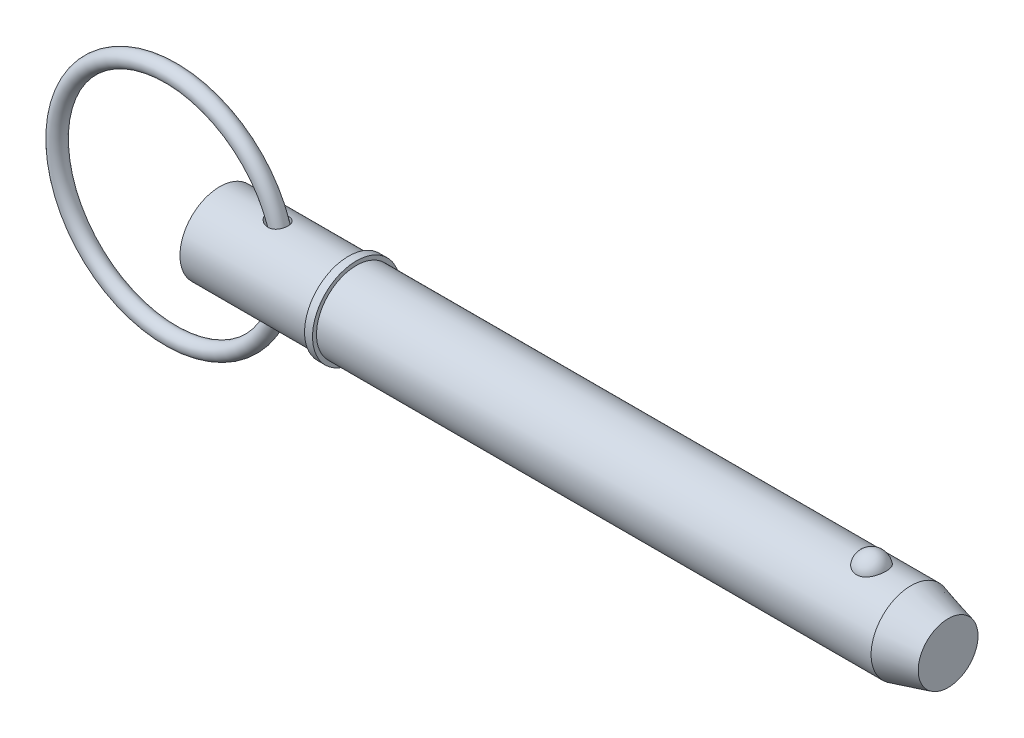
ISO-10303-21;
HEADER;
FILE_DESCRIPTION(('STEP AP214'),'2;1');
FILE_NAME('part.step','',(''),(''),'','','');
FILE_SCHEMA(('AUTOMOTIVE_DESIGN { 1 0 10303 214 1 1 1 1 }'));
ENDSEC;
DATA;
#1=APPLICATION_CONTEXT('core data for automotive mechanical design processes');
#2=APPLICATION_PROTOCOL_DEFINITION('international standard','automotive_design',2000,#1);
#3=PRODUCT_CONTEXT('',#1,'mechanical');
#4=PRODUCT('Part','Part','',(#3));
#5=PRODUCT_RELATED_PRODUCT_CATEGORY('part','',(#4));
#6=PRODUCT_DEFINITION_FORMATION('','',#4);
#7=PRODUCT_DEFINITION_CONTEXT('part definition',#1,'design');
#8=PRODUCT_DEFINITION('design','',#6,#7);
#9=PRODUCT_DEFINITION_SHAPE('','',#8);
#10=(LENGTH_UNIT() NAMED_UNIT(*) SI_UNIT(.MILLI.,.METRE.));
#11=(NAMED_UNIT(*) PLANE_ANGLE_UNIT() SI_UNIT($,.RADIAN.));
#12=(NAMED_UNIT(*) SI_UNIT($,.STERADIAN.) SOLID_ANGLE_UNIT());
#13=UNCERTAINTY_MEASURE_WITH_UNIT(LENGTH_MEASURE(1.E-05),#10,'distance_accuracy_value','');
#14=(GEOMETRIC_REPRESENTATION_CONTEXT(3) GLOBAL_UNCERTAINTY_ASSIGNED_CONTEXT((#13)) GLOBAL_UNIT_ASSIGNED_CONTEXT((#10,
#11,#12)) REPRESENTATION_CONTEXT('',''));
#15=CARTESIAN_POINT('',(0.,0.,0.));
#16=DIRECTION('',(0.,0.,1.));
#17=DIRECTION('',(1.,0.,0.));
#18=AXIS2_PLACEMENT_3D('',#15,#16,#17);
#19=CARTESIAN_POINT('',(-13.640845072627,0.,0.));
#20=DIRECTION('',(0.,0.,1.));
#21=DIRECTION('',(1.,0.,0.));
#22=AXIS2_PLACEMENT_3D('',#19,#20,#21);
#23=TOROIDAL_SURFACE('',#22,31.75,2.223);
#24=CARTESIAN_POINT('',(20.332154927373,0.,0.));
#25=VERTEX_POINT('',#24);
#26=VERTEX_LOOP('',#25);
#27=FACE_BOUND('',#26,.T.);
#28=ADVANCED_FACE('P0_F12',(#27),#23,.T.);
#29=CLOSED_SHELL('',(#28));
#30=MANIFOLD_SOLID_BREP('P0_B1',#29);
#31=CARTESIAN_POINT('',(0.,0.,0.));
#32=DIRECTION('',(1.,0.,0.));
#33=DIRECTION('',(0.,0.,-1.));
#34=AXIS2_PLACEMENT_3D('',#31,#32,#33);
#35=CYLINDRICAL_SURFACE('',#34,11.115);
#36=CARTESIAN_POINT('',(13.5245830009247,11.0328953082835,-1.34849772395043));
#37=CARTESIAN_POINT('',(13.6190616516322,11.0150940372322,-1.49413162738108));
#38=CARTESIAN_POINT('',(13.7272589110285,10.9954577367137,-1.63076546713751));
#39=CARTESIAN_POINT('',(13.9654537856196,10.9550099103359,-1.8834727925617));
#40=CARTESIAN_POINT('',(14.0954990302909,10.9341958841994,-1.99950019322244));
#41=CARTESIAN_POINT('',(14.3718600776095,10.893854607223,-2.20871939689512));
#42=CARTESIAN_POINT('',(14.5180879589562,10.8743212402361,-2.30202655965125));
#43=CARTESIAN_POINT('',(14.8233821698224,10.8385071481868,-2.46515115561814));
#44=CARTESIAN_POINT('',(14.9824448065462,10.8222254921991,-2.53497531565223));
#45=CARTESIAN_POINT('',(15.3233581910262,10.7936101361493,-2.65430007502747));
#46=CARTESIAN_POINT('',(15.5060064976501,10.7817126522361,-2.7016502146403));
#47=CARTESIAN_POINT('',(15.8771124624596,10.7657570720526,-2.76455948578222));
#48=CARTESIAN_POINT('',(16.0655695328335,10.7616981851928,-2.78012182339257));
#49=CARTESIAN_POINT('',(16.4345152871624,10.7624400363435,-2.77724928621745));
#50=CARTESIAN_POINT('',(16.6150121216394,10.7668823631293,-2.76018977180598));
#51=CARTESIAN_POINT('',(16.9695132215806,10.7837407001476,-2.69357457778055));
#52=CARTESIAN_POINT('',(17.1435222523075,10.7961507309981,-2.64404326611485));
#53=CARTESIAN_POINT('',(17.4621418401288,10.8258984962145,-2.51928348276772));
#54=CARTESIAN_POINT('',(17.6079677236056,10.8426430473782,-2.44700611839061));
#55=CARTESIAN_POINT('',(17.884162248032,10.8794194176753,-2.27791740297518));
#56=CARTESIAN_POINT('',(18.0145349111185,10.8994503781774,-2.18111245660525));
#57=CARTESIAN_POINT('',(18.2494965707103,10.9392822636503,-1.9713196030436));
#58=CARTESIAN_POINT('',(18.3550661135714,10.9590421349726,-1.85941863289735));
#59=CARTESIAN_POINT('',(18.5458147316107,10.9970986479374,-1.61919918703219));
#60=CARTESIAN_POINT('',(18.6309947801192,11.0153953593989,-1.49088149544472));
#61=CARTESIAN_POINT('',(18.7786686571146,11.0484675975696,-1.2218388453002));
#62=CARTESIAN_POINT('',(18.8412214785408,11.063252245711,-1.08114735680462));
#63=CARTESIAN_POINT('',(18.9425265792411,11.0877718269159,-0.791025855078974));
#64=CARTESIAN_POINT('',(18.9812780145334,11.0975065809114,-0.641595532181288));
#65=CARTESIAN_POINT('',(19.0343305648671,11.1109435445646,-0.336997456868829));
#66=CARTESIAN_POINT('',(19.0484404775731,11.1145985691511,-0.181794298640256));
#67=CARTESIAN_POINT('',(19.0513147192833,11.1153384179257,0.1288646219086));
#68=CARTESIAN_POINT('',(19.0400783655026,11.112423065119,0.284320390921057));
#69=CARTESIAN_POINT('',(18.9924362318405,11.1003163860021,0.591525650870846));
#70=CARTESIAN_POINT('',(18.9559600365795,11.0911075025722,0.743263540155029));
#71=CARTESIAN_POINT('',(18.858576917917,11.0673920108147,1.03825247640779));
#72=CARTESIAN_POINT('',(18.7976699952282,11.0528854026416,1.18150352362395));
#73=CARTESIAN_POINT('',(18.6529960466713,11.020201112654,1.45511394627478));
#74=CARTESIAN_POINT('',(18.5692772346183,11.0020311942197,1.58549973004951));
#75=CARTESIAN_POINT('',(18.3810003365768,10.9640237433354,1.82995492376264));
#76=CARTESIAN_POINT('',(18.2764441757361,10.9441863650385,1.9440258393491));
#77=CARTESIAN_POINT('',(18.0501398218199,10.9052267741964,2.15183128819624));
#78=CARTESIAN_POINT('',(17.9285270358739,10.8861003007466,2.24571250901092));
#79=CARTESIAN_POINT('',(17.6709592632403,10.8505244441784,2.41175942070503));
#80=CARTESIAN_POINT('',(17.5350055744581,10.8340748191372,2.48392707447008));
#81=CARTESIAN_POINT('',(17.2528390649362,10.8056099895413,2.60497667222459));
#82=CARTESIAN_POINT('',(17.1066353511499,10.7935909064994,2.65387899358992));
#83=CARTESIAN_POINT('',(16.8080326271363,10.7750969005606,2.72799859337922));
#84=CARTESIAN_POINT('',(16.6556326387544,10.7686228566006,2.75321211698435));
#85=CARTESIAN_POINT('',(16.3428877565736,10.761517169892,2.78086153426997));
#86=CARTESIAN_POINT('',(16.1824599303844,10.7611149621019,2.78240297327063));
#87=CARTESIAN_POINT('',(15.863296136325,10.766478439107,2.76156874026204));
#88=CARTESIAN_POINT('',(15.7045607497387,10.7722461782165,2.73918510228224));
#89=CARTESIAN_POINT('',(15.3787211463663,10.7898500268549,2.66904167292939));
#90=CARTESIAN_POINT('',(15.2120794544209,10.8021675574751,2.6192557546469));
#91=CARTESIAN_POINT('',(14.8886284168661,10.8315482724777,2.4949635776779));
#92=CARTESIAN_POINT('',(14.731827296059,10.8486153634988,2.42043695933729));
#93=CARTESIAN_POINT('',(14.4198762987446,10.8870804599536,2.24137362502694));
#94=CARTESIAN_POINT('',(14.2658484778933,10.9087148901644,2.13492229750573));
#95=CARTESIAN_POINT('',(13.9788214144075,10.9526299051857,1.89676517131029));
#96=CARTESIAN_POINT('',(13.845804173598,10.9749099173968,1.76508120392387));
#97=CARTESIAN_POINT('',(13.6310853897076,11.012885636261,1.50762337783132));
#98=CARTESIAN_POINT('',(13.5444453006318,11.0290026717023,1.38602082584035));
#99=CARTESIAN_POINT('',(13.392158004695,11.0581740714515,1.12983363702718));
#100=CARTESIAN_POINT('',(13.3264946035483,11.0712307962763,0.995259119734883));
#101=CARTESIAN_POINT('',(13.2464179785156,11.0874250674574,0.785640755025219));
#102=CARTESIAN_POINT('',(13.2227369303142,11.0922707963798,0.71416661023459));
#103=CARTESIAN_POINT('',(13.1820656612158,11.1006486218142,0.56927708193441));
#104=CARTESIAN_POINT('',(13.1650721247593,11.1041813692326,0.495862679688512));
#105=CARTESIAN_POINT('',(13.1381118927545,11.1098070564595,0.34771199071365));
#106=CARTESIAN_POINT('',(13.1281436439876,11.1119003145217,0.272975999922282));
#107=CARTESIAN_POINT('',(13.1154243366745,11.1145746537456,0.122890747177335));
#108=CARTESIAN_POINT('',(13.1126723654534,11.1151559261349,0.0475415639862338));
#109=CARTESIAN_POINT('',(13.1151602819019,11.1146296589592,-0.160384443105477));
#110=CARTESIAN_POINT('',(13.128061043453,11.111903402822,-0.292944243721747));
#111=CARTESIAN_POINT('',(13.175691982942,11.1019662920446,-0.553751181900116));
#112=CARTESIAN_POINT('',(13.2104121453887,11.094757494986,-0.682000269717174));
#113=CARTESIAN_POINT('',(13.2891255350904,11.0787645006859,-0.901873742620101));
#114=CARTESIAN_POINT('',(13.3290466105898,11.0707438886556,-0.995044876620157));
#115=CARTESIAN_POINT('',(13.4192915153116,11.0529876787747,-1.175992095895));
#116=CARTESIAN_POINT('',(13.4696154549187,11.0432520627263,-1.26376812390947));
#117=CARTESIAN_POINT('',(13.5245830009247,11.0328953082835,-1.34849772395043));
#118=B_SPLINE_CURVE_WITH_KNOTS('',3,(#36,#37,#38,#39,#40,#41,#42,#43,#44,#45,#46,#47,#48,#49,
#50,#51,#52,#53,#54,#55,#56,#57,#58,#59,#60,#61,#62,#63,#64,#65,#66,#67,#68,#69,#70,#71,#72,#73,
#74,#75,#76,#77,#78,#79,#80,#81,#82,#83,#84,#85,#86,#87,#88,#89,#90,#91,#92,#93,#94,#95,#96,#97,
#98,#99,#100,#101,#102,#103,#104,#105,#106,#107,#108,#109,#110,#111,#112,#113,#114,#115,#116,
#117),.UNSPECIFIED.,.T.,.F.,(4,2,2,2,2,2,2,2,2,2,2,2,2,2,2,2,2,2,2,2,2,2,2,2,2,2,2,2,2,2,2,2,2,
2,2,2,2,2,2,2,4),(0.,0.523099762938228,1.04735506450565,1.5688902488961,2.09027590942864,
2.65465173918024,3.21897064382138,3.76002078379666,4.30066536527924,4.78898318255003,
5.27717362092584,5.74028268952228,6.20336964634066,6.66524040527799,7.12712754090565,
7.59258295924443,8.05805091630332,8.52482272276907,8.99159451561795,9.45738731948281,
9.92313710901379,10.3853792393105,10.8475795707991,11.3093743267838,11.771242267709,
12.2505208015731,12.7299589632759,13.2508366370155,13.7721440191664,14.334890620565,
14.8971525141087,15.3459336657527,15.7943675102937,16.0204422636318,16.2464047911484,
16.4723173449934,16.6982013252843,17.095711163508,17.4930386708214,17.7973741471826,
18.1017128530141),.UNSPECIFIED.);
#119=CARTESIAN_POINT('',(13.5245830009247,11.0328953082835,-1.34849772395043));
#120=VERTEX_POINT('',#119);
#121=EDGE_CURVE('P1_E42',#120,#120,#118,.T.);
#122=ORIENTED_EDGE('',*,*,#121,.T.);
#123=EDGE_LOOP('',(#122));
#124=FACE_BOUND('',#123,.T.);
#125=CARTESIAN_POINT('',(0.,0.,0.));
#126=DIRECTION('',(1.,0.,0.));
#127=DIRECTION('',(0.,0.,-1.));
#128=AXIS2_PLACEMENT_3D('',#125,#126,#127);
#129=CIRCLE('',#128,11.115);
#130=CARTESIAN_POINT('',(0.,0.,-11.115));
#131=VERTEX_POINT('',#130);
#132=EDGE_CURVE('P1_E9',#131,#131,#129,.T.);
#133=ORIENTED_EDGE('',*,*,#132,.T.);
#134=EDGE_LOOP('',(#133));
#135=FACE_BOUND('',#134,.T.);
#136=CARTESIAN_POINT('',(35.877,0.,0.));
#137=DIRECTION('',(1.,0.,0.));
#138=DIRECTION('',(0.,0.,-1.));
#139=AXIS2_PLACEMENT_3D('',#136,#137,#138);
#140=CIRCLE('',#139,11.115);
#141=CARTESIAN_POINT('',(35.877,0.,-11.115));
#142=VERTEX_POINT('',#141);
#143=EDGE_CURVE('P1_E25',#142,#142,#140,.T.);
#144=ORIENTED_EDGE('',*,*,#143,.F.);
#145=EDGE_LOOP('',(#144));
#146=FACE_BOUND('',#145,.T.);
#147=CARTESIAN_POINT('',(13.5245830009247,-11.0328953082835,-1.34849772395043));
#148=CARTESIAN_POINT('',(13.449887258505,-11.0469690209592,-1.233356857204));
#149=CARTESIAN_POINT('',(13.3837464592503,-11.0598986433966,-1.11255897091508));
#150=CARTESIAN_POINT('',(13.271526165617,-11.0822620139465,-0.861680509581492));
#151=CARTESIAN_POINT('',(13.2254273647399,-11.0916991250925,-0.731609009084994));
#152=CARTESIAN_POINT('',(13.1557497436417,-11.1060943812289,-0.464578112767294));
#153=CARTESIAN_POINT('',(13.1322820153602,-11.111030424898,-0.327588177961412));
#154=CARTESIAN_POINT('',(13.1098958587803,-11.1157368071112,-0.0515139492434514));
#155=CARTESIAN_POINT('',(13.1109730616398,-11.1155080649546,0.087569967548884));
#156=CARTESIAN_POINT('',(13.1367722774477,-11.110088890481,0.354927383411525));
#157=CARTESIAN_POINT('',(13.160070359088,-11.1051972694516,0.483348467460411));
#158=CARTESIAN_POINT('',(13.2268311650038,-11.091413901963,0.734581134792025));
#159=CARTESIAN_POINT('',(13.2702981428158,-11.0825213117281,0.857391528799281));
#160=CARTESIAN_POINT('',(13.3769008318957,-11.0612491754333,1.09871322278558));
#161=CARTESIAN_POINT('',(13.4406446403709,-11.048763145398,1.21694419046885));
#162=CARTESIAN_POINT('',(13.5844860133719,-11.0215642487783,1.44267020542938));
#163=CARTESIAN_POINT('',(13.6645903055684,-11.0068504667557,1.55016080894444));
#164=CARTESIAN_POINT('',(13.8511803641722,-10.9741237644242,1.76795565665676));
#165=CARTESIAN_POINT('',(13.959808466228,-10.9559422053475,1.87639683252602));
#166=CARTESIAN_POINT('',(14.1916437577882,-10.9197998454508,2.07642617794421));
#167=CARTESIAN_POINT('',(14.3148607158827,-10.901839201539,2.16800294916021));
#168=CARTESIAN_POINT('',(14.5931107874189,-10.8649902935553,2.34622033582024));
#169=CARTESIAN_POINT('',(14.7501095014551,-10.8463937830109,2.42986679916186));
#170=CARTESIAN_POINT('',(15.0757118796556,-10.8136392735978,2.57171975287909));
#171=CARTESIAN_POINT('',(15.2443214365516,-10.7994835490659,2.62991321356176));
#172=CARTESIAN_POINT('',(15.599068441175,-10.7767894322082,2.72147498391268));
#173=CARTESIAN_POINT('',(15.7856559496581,-10.768622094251,2.75321798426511));
#174=CARTESIAN_POINT('',(16.1617095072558,-10.7608206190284,2.78356776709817));
#175=CARTESIAN_POINT('',(16.3511739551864,-10.7611818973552,2.78219235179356));
#176=CARTESIAN_POINT('',(16.7138126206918,-10.7705428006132,2.7457129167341));
#177=CARTESIAN_POINT('',(16.8872269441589,-10.7789612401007,2.71287798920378));
#178=CARTESIAN_POINT('',(17.2247245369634,-10.8028011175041,2.61632772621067));
#179=CARTESIAN_POINT('',(17.3888134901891,-10.8182182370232,2.55263143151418));
#180=CARTESIAN_POINT('',(17.6871641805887,-10.8524191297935,2.40281428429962));
#181=CARTESIAN_POINT('',(17.8227812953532,-10.8707652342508,2.31928155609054));
#182=CARTESIAN_POINT('',(18.0770765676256,-10.9094513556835,2.12988301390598));
#183=CARTESIAN_POINT('',(18.1957578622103,-10.9297910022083,2.02402134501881));
#184=CARTESIAN_POINT('',(18.4088055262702,-10.9693230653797,1.79719870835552));
#185=CARTESIAN_POINT('',(18.5038890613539,-10.9885305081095,1.67691225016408));
#186=CARTESIAN_POINT('',(18.6726701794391,-11.0244347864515,1.42183894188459));
#187=CARTESIAN_POINT('',(18.7463681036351,-11.0411316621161,1.28705232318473));
#188=CARTESIAN_POINT('',(18.8708297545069,-11.0702507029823,1.00634471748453));
#189=CARTESIAN_POINT('',(18.9215212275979,-11.0826593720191,0.860390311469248));
#190=CARTESIAN_POINT('',(18.9984973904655,-11.1017993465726,0.561823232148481));
#191=CARTESIAN_POINT('',(19.0247811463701,-11.1085304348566,0.409210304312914));
#192=CARTESIAN_POINT('',(19.0524622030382,-11.1156244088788,0.100537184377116));
#193=CARTESIAN_POINT('',(19.0536873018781,-11.1159432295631,-0.0555394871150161));
#194=CARTESIAN_POINT('',(19.0307837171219,-11.110065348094,-0.365700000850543));
#195=CARTESIAN_POINT('',(19.0066544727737,-11.1038685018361,-0.519783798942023));
#196=CARTESIAN_POINT('',(18.9335163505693,-11.0856111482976,-0.821817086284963));
#197=CARTESIAN_POINT('',(18.8844701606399,-11.0735418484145,-0.969757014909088));
#198=CARTESIAN_POINT('',(18.7625929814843,-11.0448501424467,-1.25502066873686));
#199=CARTESIAN_POINT('',(18.6897623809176,-11.0282278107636,-1.39234456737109));
#200=CARTESIAN_POINT('',(18.522359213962,-10.9923333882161,-1.65195905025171));
#201=CARTESIAN_POINT('',(18.427863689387,-10.9730707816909,-1.77430060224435));
#202=CARTESIAN_POINT('',(18.2194216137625,-10.9340072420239,-2.00099176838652));
#203=CARTESIAN_POINT('',(18.1054772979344,-10.9142063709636,-2.10534344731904));
#204=CARTESIAN_POINT('',(17.8622613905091,-10.8764452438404,-2.2924289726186));
#205=CARTESIAN_POINT('',(17.7331196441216,-10.8584715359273,-2.3753290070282));
#206=CARTESIAN_POINT('',(17.4625069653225,-10.8261386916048,-2.51860389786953));
#207=CARTESIAN_POINT('',(17.3210365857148,-10.8117793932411,-2.57897976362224));
#208=CARTESIAN_POINT('',(17.0290309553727,-10.7880576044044,-2.67648805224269));
#209=CARTESIAN_POINT('',(16.8784484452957,-10.7787241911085,-2.71348542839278));
#210=CARTESIAN_POINT('',(16.573148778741,-10.7659618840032,-2.7636855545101));
#211=CARTESIAN_POINT('',(16.4184306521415,-10.7625343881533,-2.77688267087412));
#212=CARTESIAN_POINT('',(16.1008073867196,-10.761643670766,-2.78033419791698));
#213=CARTESIAN_POINT('',(15.9378898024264,-10.7644957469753,-2.76937572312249));
#214=CARTESIAN_POINT('',(15.6157286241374,-10.7762062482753,-2.72344300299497));
#215=CARTESIAN_POINT('',(15.4564861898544,-10.7850665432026,-2.68846128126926));
#216=CARTESIAN_POINT('',(15.1305734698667,-10.808737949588,-2.59174021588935));
#217=CARTESIAN_POINT('',(14.9645834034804,-10.8240246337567,-2.52782071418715));
#218=CARTESIAN_POINT('',(14.6448218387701,-10.8585969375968,-2.37491543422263));
#219=CARTESIAN_POINT('',(14.4910653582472,-10.8778873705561,-2.28589943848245));
#220=CARTESIAN_POINT('',(14.1837929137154,-10.920550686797,-2.07312951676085));
#221=CARTESIAN_POINT('',(14.0321999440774,-10.9441390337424,-1.94661563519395));
#222=CARTESIAN_POINT('',(13.756115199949,-10.9902311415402,-1.66673537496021));
#223=CARTESIAN_POINT('',(13.6315733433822,-11.0127368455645,-1.51341958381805));
#224=CARTESIAN_POINT('',(13.5245830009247,-11.0328953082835,-1.34849772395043));
#225=B_SPLINE_CURVE_WITH_KNOTS('',3,(#147,#148,#149,#150,#151,#152,#153,#154,#155,#156,#157,
#158,#159,#160,#161,#162,#163,#164,#165,#166,#167,#168,#169,#170,#171,#172,#173,#174,#175,#176,
#177,#178,#179,#180,#181,#182,#183,#184,#185,#186,#187,#188,#189,#190,#191,#192,#193,#194,#195,
#196,#197,#198,#199,#200,#201,#202,#203,#204,#205,#206,#207,#208,#209,#210,#211,#212,#213,#214,
#215,#216,#217,#218,#219,#220,#221,#222,#223,#224),.UNSPECIFIED.,.T.,.F.,(4,2,2,2,2,2,2,2,2,2,2,
2,2,2,2,2,2,2,2,2,2,2,2,2,2,2,2,2,2,2,2,2,2,2,2,2,2,2,4),(0.,0.413394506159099,
0.826389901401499,1.24140245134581,1.65634113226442,2.04635967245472,2.43646050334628,
2.83958259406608,3.24287078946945,3.70479277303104,4.16702582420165,4.70130512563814,
5.23585761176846,5.80123945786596,6.36631739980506,6.89348344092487,7.42032464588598,
7.8989135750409,8.37741373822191,8.83881993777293,9.30021877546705,9.76305681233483,
10.2259125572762,10.6919479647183,11.1579936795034,11.6247393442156,12.0914773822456,
12.55658073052,13.0216306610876,13.4829619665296,13.9442725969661,14.408224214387,
14.8722856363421,15.3601762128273,15.8482186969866,16.3815107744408,16.9154477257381,
17.5086806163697,18.1008056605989),.UNSPECIFIED.);
#226=CARTESIAN_POINT('',(13.5245830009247,-11.0328953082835,-1.34849772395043));
#227=VERTEX_POINT('',#226);
#228=EDGE_CURVE('P1_E17',#227,#227,#225,.T.);
#229=ORIENTED_EDGE('',*,*,#228,.T.);
#230=EDGE_LOOP('',(#229));
#231=FACE_BOUND('',#230,.T.);
#232=ADVANCED_FACE('P1_F13',(#124,#135,#146,#231),#35,.T.);
#233=CARTESIAN_POINT('',(0.,0.,0.));
#234=DIRECTION('',(1.,0.,0.));
#235=DIRECTION('',(0.,0.,-1.));
#236=AXIS2_PLACEMENT_3D('',#233,#234,#235);
#237=CYLINDRICAL_SURFACE('',#236,11.115);
#238=CARTESIAN_POINT('',(192.829563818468,0.,0.));
#239=DIRECTION('',(1.,0.,0.));
#240=DIRECTION('',(0.,0.,-1.));
#241=AXIS2_PLACEMENT_3D('',#238,#239,#240);
#242=CIRCLE('',#241,11.115);
#243=CARTESIAN_POINT('',(192.829563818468,0.,-11.115));
#244=VERTEX_POINT('',#243);
#245=EDGE_CURVE('P1_E99',#244,#244,#242,.T.);
#246=ORIENTED_EDGE('',*,*,#245,.F.);
#247=EDGE_LOOP('',(#246));
#248=FACE_BOUND('',#247,.T.);
#249=CARTESIAN_POINT('',(38.1,0.,0.));
#250=DIRECTION('',(1.,0.,0.));
#251=DIRECTION('',(0.,0.,-1.));
#252=AXIS2_PLACEMENT_3D('',#249,#250,#251);
#253=CIRCLE('',#252,11.115);
#254=CARTESIAN_POINT('',(38.1,0.,-11.115));
#255=VERTEX_POINT('',#254);
#256=EDGE_CURVE('P1_E96',#255,#255,#253,.T.);
#257=ORIENTED_EDGE('',*,*,#256,.T.);
#258=EDGE_LOOP('',(#257));
#259=FACE_BOUND('',#258,.T.);
#260=CARTESIAN_POINT('',(181.831068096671,10.3028087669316,4.17077409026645));
#261=CARTESIAN_POINT('',(181.614775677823,10.3028003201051,4.17078240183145));
#262=CARTESIAN_POINT('',(181.398548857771,10.3098895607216,4.15340593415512));
#263=CARTESIAN_POINT('',(180.972540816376,10.3373834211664,4.08449540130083));
#264=CARTESIAN_POINT('',(180.762757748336,10.3577841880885,4.0329712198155));
#265=CARTESIAN_POINT('',(180.355782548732,10.4095237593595,3.89746513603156));
#266=CARTESIAN_POINT('',(180.158572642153,10.4408466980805,3.81353029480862));
#267=CARTESIAN_POINT('',(179.781338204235,10.5110236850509,3.61560339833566));
#268=CARTESIAN_POINT('',(179.601317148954,10.5498792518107,3.50160528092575));
#269=CARTESIAN_POINT('',(179.257684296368,10.6322884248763,3.24292464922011));
#270=CARTESIAN_POINT('',(179.094686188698,10.6759443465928,3.09746040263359));
#271=CARTESIAN_POINT('',(178.794591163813,10.7625291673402,2.7817192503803));
#272=CARTESIAN_POINT('',(178.657499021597,10.8054579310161,2.61143778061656));
#273=CARTESIAN_POINT('',(178.406408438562,10.8881935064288,2.24226695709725));
#274=CARTESIAN_POINT('',(178.293710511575,10.9277761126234,2.04244123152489));
#275=CARTESIAN_POINT('',(178.101777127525,10.997484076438,1.62578254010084));
#276=CARTESIAN_POINT('',(178.022544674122,11.0276085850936,1.40894804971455));
#277=CARTESIAN_POINT('',(177.898303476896,11.0756732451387,0.961250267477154));
#278=CARTESIAN_POINT('',(177.853760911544,11.0934470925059,0.730239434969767));
#279=CARTESIAN_POINT('',(177.801569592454,11.1143331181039,0.263439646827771));
#280=CARTESIAN_POINT('',(177.793920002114,11.1174456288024,0.0276507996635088));
#281=CARTESIAN_POINT('',(177.81561056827,11.1087161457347,-0.440729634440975));
#282=CARTESIAN_POINT('',(177.844762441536,11.0969502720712,-0.673331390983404));
#283=CARTESIAN_POINT('',(177.939143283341,11.0597872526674,-1.12996621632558));
#284=CARTESIAN_POINT('',(178.004372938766,11.0343898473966,-1.35399912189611));
#285=CARTESIAN_POINT('',(178.16969844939,10.972515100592,-1.78750286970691));
#286=CARTESIAN_POINT('',(178.26983863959,10.9360236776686,-1.99695478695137));
#287=CARTESIAN_POINT('',(178.502940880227,10.8557595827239,-2.39520667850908));
#288=CARTESIAN_POINT('',(178.635905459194,10.8119863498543,-2.58400506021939));
#289=CARTESIAN_POINT('',(178.932407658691,10.7216733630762,-2.93635726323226));
#290=CARTESIAN_POINT('',(179.096056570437,10.675123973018,-3.09981510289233));
#291=CARTESIAN_POINT('',(179.449860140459,10.5846571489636,-3.39592247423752));
#292=CARTESIAN_POINT('',(179.640012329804,10.5407394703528,-3.52857487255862));
#293=CARTESIAN_POINT('',(180.03750141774,10.4616690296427,-3.75646057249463));
#294=CARTESIAN_POINT('',(180.24436705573,10.4263443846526,-3.85245432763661));
#295=CARTESIAN_POINT('',(180.672954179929,10.3675574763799,-4.00798747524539));
#296=CARTESIAN_POINT('',(180.894670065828,10.344090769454,-4.0675405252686));
#297=CARTESIAN_POINT('',(181.334669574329,10.3128282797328,-4.14614314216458));
#298=CARTESIAN_POINT('',(181.552565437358,10.3043040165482,-4.1670783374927));
#299=CARTESIAN_POINT('',(181.98894951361,10.3016771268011,-4.17357158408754));
#300=CARTESIAN_POINT('',(182.207437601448,10.3075716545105,-4.15913661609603));
#301=CARTESIAN_POINT('',(182.631744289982,10.3326686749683,-4.09636961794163));
#302=CARTESIAN_POINT('',(182.837745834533,10.3514555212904,-4.0490957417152));
#303=CARTESIAN_POINT('',(183.238576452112,10.399818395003,-3.92320197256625));
#304=CARTESIAN_POINT('',(183.4334046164,10.4293952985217,-3.84457953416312));
#305=CARTESIAN_POINT('',(183.811191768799,10.4969600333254,-3.65612410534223));
#306=CARTESIAN_POINT('',(183.993797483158,10.5351178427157,-3.54564545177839));
#307=CARTESIAN_POINT('',(184.338204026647,10.6154999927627,-3.29718036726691));
#308=CARTESIAN_POINT('',(184.500000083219,10.657725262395,-3.15918764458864));
#309=CARTESIAN_POINT('',(184.806959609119,10.744212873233,-2.85163580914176));
#310=CARTESIAN_POINT('',(184.950891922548,10.7884718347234,-2.68084605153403));
#311=CARTESIAN_POINT('',(185.209237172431,10.872374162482,-2.31721864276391));
#312=CARTESIAN_POINT('',(185.323644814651,10.9120167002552,-2.12437704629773));
#313=CARTESIAN_POINT('',(185.523873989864,10.9838919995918,-1.71516999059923));
#314=CARTESIAN_POINT('',(185.60866178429,11.0158465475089,-1.49824866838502));
#315=CARTESIAN_POINT('',(185.74268382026,11.0673523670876,-1.05228572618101));
#316=CARTESIAN_POINT('',(185.791917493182,11.086903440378,-0.823243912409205));
#317=CARTESIAN_POINT('',(185.853891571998,11.1116323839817,-0.359087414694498));
#318=CARTESIAN_POINT('',(185.866566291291,11.1167843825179,-0.123962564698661));
#319=CARTESIAN_POINT('',(185.854973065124,11.1121144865,0.345220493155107));
#320=CARTESIAN_POINT('',(185.830705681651,11.1022928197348,0.579278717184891));
#321=CARTESIAN_POINT('',(185.745907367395,11.0687504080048,1.03866534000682));
#322=CARTESIAN_POINT('',(185.685529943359,11.0450885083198,1.26402641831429));
#323=CARTESIAN_POINT('',(185.529853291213,10.9863185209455,1.70076772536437));
#324=CARTESIAN_POINT('',(185.434551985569,10.9512097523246,1.91214712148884));
#325=CARTESIAN_POINT('',(185.210397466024,10.8729733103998,2.316083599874));
#326=CARTESIAN_POINT('',(185.081380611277,10.8298068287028,2.50854240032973));
#327=CARTESIAN_POINT('',(184.792732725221,10.7401896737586,2.86808766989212));
#328=CARTESIAN_POINT('',(184.633102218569,10.6937390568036,3.03517457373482));
#329=CARTESIAN_POINT('',(184.287534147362,10.6029321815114,3.33857581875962));
#330=CARTESIAN_POINT('',(184.101708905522,10.5585680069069,3.47501541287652));
#331=CARTESIAN_POINT('',(183.707875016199,10.4769321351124,3.71390897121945));
#332=CARTESIAN_POINT('',(183.499863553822,10.439661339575,3.81635861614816));
#333=CARTESIAN_POINT('',(183.054066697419,10.3749407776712,3.98910631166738));
#334=CARTESIAN_POINT('',(182.815234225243,10.3482457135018,4.05700929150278));
#335=CARTESIAN_POINT('',(182.327925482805,10.312188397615,4.14782844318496));
#336=CARTESIAN_POINT('',(182.079453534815,10.3028184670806,4.17076454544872));
#337=CARTESIAN_POINT('',(181.831068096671,10.3028087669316,4.17077409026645));
#338=B_SPLINE_CURVE_WITH_KNOTS('',3,(#260,#261,#262,#263,#264,#265,#266,#267,#268,#269,#270,
#271,#272,#273,#274,#275,#276,#277,#278,#279,#280,#281,#282,#283,#284,#285,#286,#287,#288,#289,
#290,#291,#292,#293,#294,#295,#296,#297,#298,#299,#300,#301,#302,#303,#304,#305,#306,#307,#308,
#309,#310,#311,#312,#313,#314,#315,#316,#317,#318,#319,#320,#321,#322,#323,#324,#325,#326,#327,
#328,#329,#330,#331,#332,#333,#334,#335,#336,#337),.UNSPECIFIED.,.T.,.F.,(4,2,2,2,2,2,2,2,2,2,2,
2,2,2,2,2,2,2,2,2,2,2,2,2,2,2,2,2,2,2,2,2,2,2,2,2,2,2,4),(0.,0.64796614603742,1.29574482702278,
1.9425864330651,2.58955857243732,3.25496465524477,3.92049326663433,4.61566368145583,
5.31089647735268,6.01531821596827,6.71972398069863,7.42054043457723,8.12137023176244,
8.82309331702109,9.5248704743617,10.2292439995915,10.9335519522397,11.6223330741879,
12.3108558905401,12.9647664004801,13.6185478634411,14.252184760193,14.8858731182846,
15.5334360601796,16.1811472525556,16.8611459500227,17.5412664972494,18.2431855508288,
18.9451158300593,19.6483065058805,20.3514864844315,21.0516982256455,21.7519516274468,
22.4556690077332,23.1593743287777,23.8601491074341,24.5610129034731,25.3054529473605,
26.049562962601),.UNSPECIFIED.);
#339=CARTESIAN_POINT('',(181.831068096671,10.3028087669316,4.17077409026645));
#340=VERTEX_POINT('',#339);
#341=EDGE_CURVE('P1_E34',#340,#340,#338,.T.);
#342=ORIENTED_EDGE('',*,*,#341,.T.);
#343=EDGE_LOOP('',(#342));
#344=FACE_BOUND('',#343,.T.);
#345=ADVANCED_FACE('P1_F46',(#248,#259,#344),#237,.T.);
#346=CARTESIAN_POINT('',(0.,0.,0.));
#347=DIRECTION('',(-1.,0.,0.));
#348=DIRECTION('',(0.,0.,1.));
#349=AXIS2_PLACEMENT_3D('',#346,#347,#348);
#350=PLANE('',#349);
#351=ORIENTED_EDGE('',*,*,#132,.F.);
#352=EDGE_LOOP('',(#351));
#353=FACE_BOUND('',#352,.T.);
#354=ADVANCED_FACE('P1_F15',(#353),#350,.T.);
#355=CARTESIAN_POINT('',(35.877,11.115,0.));
#356=DIRECTION('',(-1.,0.,0.));
#357=DIRECTION('',(0.,0.,1.));
#358=AXIS2_PLACEMENT_3D('',#355,#356,#357);
#359=PLANE('',#358);
#360=ORIENTED_EDGE('',*,*,#143,.T.);
#361=EDGE_LOOP('',(#360));
#362=FACE_BOUND('',#361,.T.);
#363=CARTESIAN_POINT('',(35.877,0.,0.));
#364=DIRECTION('',(1.,0.,0.));
#365=DIRECTION('',(0.,0.,-1.));
#366=AXIS2_PLACEMENT_3D('',#363,#364,#365);
#367=CIRCLE('',#366,12.2265);
#368=CARTESIAN_POINT('',(35.877,0.,-12.2265));
#369=VERTEX_POINT('',#368);
#370=EDGE_CURVE('P1_E30',#369,#369,#367,.T.);
#371=ORIENTED_EDGE('',*,*,#370,.F.);
#372=EDGE_LOOP('',(#371));
#373=FACE_BOUND('',#372,.T.);
#374=ADVANCED_FACE('P1_F81',(#362,#373),#359,.T.);
#375=CARTESIAN_POINT('',(0.,0.,0.));
#376=DIRECTION('',(1.,0.,0.));
#377=DIRECTION('',(0.,0.,-1.));
#378=AXIS2_PLACEMENT_3D('',#375,#376,#377);
#379=CYLINDRICAL_SURFACE('',#378,12.2265);
#380=ORIENTED_EDGE('',*,*,#370,.T.);
#381=EDGE_LOOP('',(#380));
#382=FACE_BOUND('',#381,.T.);
#383=CARTESIAN_POINT('',(38.1,0.,0.));
#384=DIRECTION('',(1.,0.,0.));
#385=DIRECTION('',(0.,0.,-1.));
#386=AXIS2_PLACEMENT_3D('',#383,#384,#385);
#387=CIRCLE('',#386,12.2265);
#388=CARTESIAN_POINT('',(38.1,0.,-12.2265));
#389=VERTEX_POINT('',#388);
#390=EDGE_CURVE('P1_E95',#389,#389,#387,.T.);
#391=ORIENTED_EDGE('',*,*,#390,.F.);
#392=EDGE_LOOP('',(#391));
#393=FACE_BOUND('',#392,.T.);
#394=ADVANCED_FACE('P1_F68',(#382,#393),#379,.T.);
#395=CARTESIAN_POINT('',(38.1,12.2265,0.));
#396=DIRECTION('',(1.,0.,0.));
#397=DIRECTION('',(0.,0.,-1.));
#398=AXIS2_PLACEMENT_3D('',#395,#396,#397);
#399=PLANE('',#398);
#400=ORIENTED_EDGE('',*,*,#390,.T.);
#401=EDGE_LOOP('',(#400));
#402=FACE_BOUND('',#401,.T.);
#403=ORIENTED_EDGE('',*,*,#256,.F.);
#404=EDGE_LOOP('',(#403));
#405=FACE_BOUND('',#404,.T.);
#406=ADVANCED_FACE('P1_F62',(#402,#405),#399,.T.);
#407=CARTESIAN_POINT('',(203.2,0.,0.));
#408=DIRECTION('',(-1.,0.,0.));
#409=DIRECTION('',(0.,0.,1.));
#410=AXIS2_PLACEMENT_3D('',#407,#408,#409);
#411=CONICAL_SURFACE('',#410,8.33625000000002,0.26179938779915);
#412=ORIENTED_EDGE('',*,*,#245,.T.);
#413=EDGE_LOOP('',(#412));
#414=FACE_BOUND('',#413,.T.);
#415=CARTESIAN_POINT('',(203.2,0.,0.));
#416=DIRECTION('',(1.,0.,0.));
#417=DIRECTION('',(0.,0.,-1.));
#418=AXIS2_PLACEMENT_3D('',#415,#416,#417);
#419=CIRCLE('',#418,8.33625000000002);
#420=CARTESIAN_POINT('',(203.2,0.,-8.33625000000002));
#421=VERTEX_POINT('',#420);
#422=EDGE_CURVE('P1_E41',#421,#421,#419,.T.);
#423=ORIENTED_EDGE('',*,*,#422,.F.);
#424=EDGE_LOOP('',(#423));
#425=FACE_BOUND('',#424,.T.);
#426=ADVANCED_FACE('P1_F59',(#414,#425),#411,.T.);
#427=CARTESIAN_POINT('',(203.2,8.33625000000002,0.));
#428=DIRECTION('',(1.,0.,0.));
#429=DIRECTION('',(0.,0.,-1.));
#430=AXIS2_PLACEMENT_3D('',#427,#428,#429);
#431=PLANE('',#430);
#432=ORIENTED_EDGE('',*,*,#422,.T.);
#433=EDGE_LOOP('',(#432));
#434=FACE_BOUND('',#433,.T.);
#435=ADVANCED_FACE('P1_F55',(#434),#431,.T.);
#436=CARTESIAN_POINT('',(181.831068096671,10.0035,0.));
#437=DIRECTION('',(-1.,0.,0.));
#438=DIRECTION('',(0.,1.,0.));
#439=AXIS2_PLACEMENT_3D('',#436,#437,#438);
#440=SPHERICAL_SURFACE('',#439,4.18150000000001);
#441=ORIENTED_EDGE('',*,*,#341,.F.);
#442=EDGE_LOOP('',(#441));
#443=FACE_BOUND('',#442,.T.);
#444=ADVANCED_FACE('P1_F50',(#443),#440,.T.);
#445=CARTESIAN_POINT('',(-13.640845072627,0.,0.));
#446=DIRECTION('',(0.,0.,1.));
#447=DIRECTION('',(1.,0.,0.));
#448=AXIS2_PLACEMENT_3D('',#445,#446,#447);
#449=TOROIDAL_SURFACE('',#448,31.75,2.77875);
#450=ORIENTED_EDGE('',*,*,#228,.F.);
#451=EDGE_LOOP('',(#450));
#452=FACE_BOUND('',#451,.T.);
#453=ORIENTED_EDGE('',*,*,#121,.F.);
#454=EDGE_LOOP('',(#453));
#455=FACE_BOUND('',#454,.T.);
#456=ADVANCED_FACE('P1_F54',(#452,#455),#449,.F.);
#457=CLOSED_SHELL('',(#232,#345,#354,#374,#394,#406,#426,#435,#444,#456));
#458=MANIFOLD_SOLID_BREP('P1_B1',#457);
#459=ADVANCED_BREP_SHAPE_REPRESENTATION('',(#18,#30,#458),#14);
#460=SHAPE_DEFINITION_REPRESENTATION(#9,#459);
ENDSEC;
END-ISO-10303-21;
